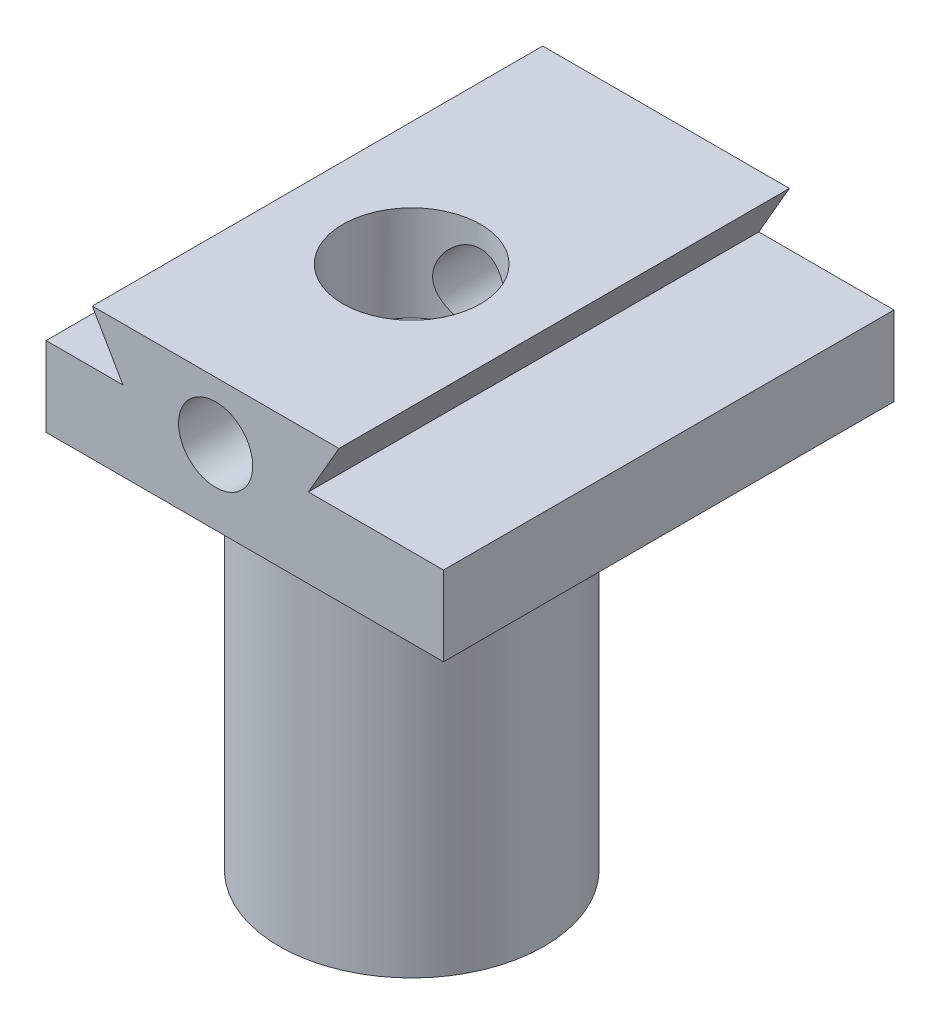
from build123d import *

# Parameters (mm, degrees)
SKETCH1_R           = 7
BOSS_EXTRUDE1_DEPTH = 85
SKETCH4_R           = 10
CUT_EXTRUDE1_DEPTH  = 85
SKETCH4_4_R         = 13
SKETCH4_4_R_2       = 10
CUT_EXTRUDE2_DEPTH  = 18
SKETCH5_R           = 25
SKETCH5_R_2         = 22
SKETCH5_R_3         = 10
BOSS_EXTRUDE4_DEPTH = 74
SKETCH5_6_R         = 25
SKETCH5_6_R_2       = 22
CUT_EXTRUDE6_DEPTH  = 3
SKETCH7_R           = 22
CUT_EXTRUDE7_DEPTH  = 7
SKETCH8_R           = 3
CUT_EXTRUDE9_DEPTH  = 17
SKETCH8_4_R         = 3
CUT_EXTRUDE10_DEPTH = 6
SKETCH9_R           = 2.5
CUT_EXTRUDE12_DEPTH = 20


with BuildPart() as part:
    # Sketch1 → Boss-Extrude1 (new body)
    with BuildSketch(Plane.XY):
        Polygon((-130.604361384, 21.085427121), (-130.604361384, 36.085427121), (-116.104361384, 36.085427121), (-121.877864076, 46.085427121), (-75.330858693, 46.085427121), (-81.104361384, 36.085427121), (-55.604361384, 36.085427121), (-55.604361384, 21.085427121), (-71.579658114, 21.085427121), (-115.579658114, 21.085427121), align=None)
        with Locations((-98.604361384, 35.085427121)):
            Circle(SKETCH1_R, mode=Mode.SUBTRACT)
    extrude(amount=BOSS_EXTRUDE1_DEPTH)

    # Sketch4 → Cut-Extrude1 (cut)
    with BuildSketch(Plane(origin=(0, 46.085427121, 0), x_dir=(1, 0, 0), z_dir=(0, 1, 0))):
        with Locations(Location((-98.604361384, -48, 0), (0, 0, 270))):
            Circle(SKETCH4_R)
    extrude(amount=-CUT_EXTRUDE1_DEPTH, mode=Mode.SUBTRACT)

    # Sketch4_4 → Cut-Extrude2 (cut)
    with BuildSketch(Plane(origin=(0, 46.085427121, 0), x_dir=(1, 0, 0), z_dir=(0, 1, 0))):
        with Locations(Location((-98.604361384, -48, 0), (0, 0, 270))):
            Circle(SKETCH4_4_R)
        with Locations(Location((-98.604361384, -48, 0), (0, 0, 270))):
            Circle(SKETCH4_4_R_2, mode=Mode.SUBTRACT)
    extrude(amount=-CUT_EXTRUDE2_DEPTH, mode=Mode.SUBTRACT)


with BuildPart() as body_2:
    # Sketch5 → Boss-Extrude4 (new body)
    # profile 1 of 2: a face of its own
    with BuildSketch(Plane.XZ.offset(-21.085427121)):
        with Locations((-98.604361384, 48)):
            Circle(SKETCH5_R)
        with Locations((-98.604361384, 48)):
            Circle(SKETCH5_R_2, mode=Mode.SUBTRACT)
    # profile 2 of 2: a face of its own
    with BuildSketch(Plane.XZ.offset(-21.085427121)):
        with Locations((-98.604361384, 48)):
            Circle(SKETCH5_R_2)
        with Locations((-98.604361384, 48)):
            Circle(SKETCH5_R_3, mode=Mode.SUBTRACT)
    extrude(amount=BOSS_EXTRUDE4_DEPTH)

    # Sketch5_6 → Cut-Extrude6 (cut)
    with BuildSketch(Plane.XZ.offset(-21.085427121)):
        with Locations((-98.604361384, 48)):
            Circle(SKETCH5_6_R)
        with Locations((-98.604361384, 48)):
            Circle(SKETCH5_6_R_2, mode=Mode.SUBTRACT)
    extrude(amount=CUT_EXTRUDE6_DEPTH, mode=Mode.SUBTRACT)

    # Sketch7 → Cut-Extrude7 (cut)
    with BuildSketch(Plane.XZ.offset(52.914572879)):
        with Locations((-98.604361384, 48)):
            Circle(SKETCH7_R)
    extrude(amount=-CUT_EXTRUDE7_DEPTH, mode=Mode.SUBTRACT)

    # Sketch8 → Cut-Extrude9 (cut)
    with BuildSketch(Plane.ZY.offset(123.604361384)):
        with Locations(Location((48, 1.085427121, 0), (0, 0, 270))):
            Circle(SKETCH8_R)
        with Locations(Location((48, -24.914572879, 0), (0, 0, 270))):
            Circle(SKETCH8_R)
    extrude(amount=-CUT_EXTRUDE9_DEPTH, mode=Mode.SUBTRACT)

    # Sketch8_4 → Cut-Extrude10 (cut)
    with BuildSketch(Plane.ZY.offset(123.604361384)):
        with BuildLine():
            ThreePointArc((55, -32.914572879), (48, -39.914572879), (41, -32.914572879))
            Line((41, -32.914572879), (41, 9.085427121))
            ThreePointArc((41, 9.085427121), (48, 16.085427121), (55, 9.085427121))
            Line((55, 9.085427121), (55, -32.914572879))
        make_face()
        with Locations(Location((48, 1.085427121, 0), (0, 0, 270))):
            Circle(SKETCH8_4_R, mode=Mode.SUBTRACT)
        with Locations(Location((48, -24.914572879, 0), (0, 0, 270))):
            Circle(SKETCH8_4_R, mode=Mode.SUBTRACT)
    extrude(amount=-CUT_EXTRUDE10_DEPTH, mode=Mode.SUBTRACT)

    # Sketch9 → Cut-Extrude12 (cut)
    with BuildSketch(Plane.XZ.offset(45.914572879)):
        with Locations((-107.79674954, 57.192388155)):
            Circle(SKETCH9_R)
        with Locations((-89.411973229, 57.192388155)):
            Circle(SKETCH9_R)
        with Locations((-89.411973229, 38.807611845)):
            Circle(SKETCH9_R)
        with Locations((-107.79674954, 38.807611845)):
            Circle(SKETCH9_R)
    extrude(amount=-CUT_EXTRUDE12_DEPTH, mode=Mode.SUBTRACT)


solid = Compound([part.part, body_2.part])
